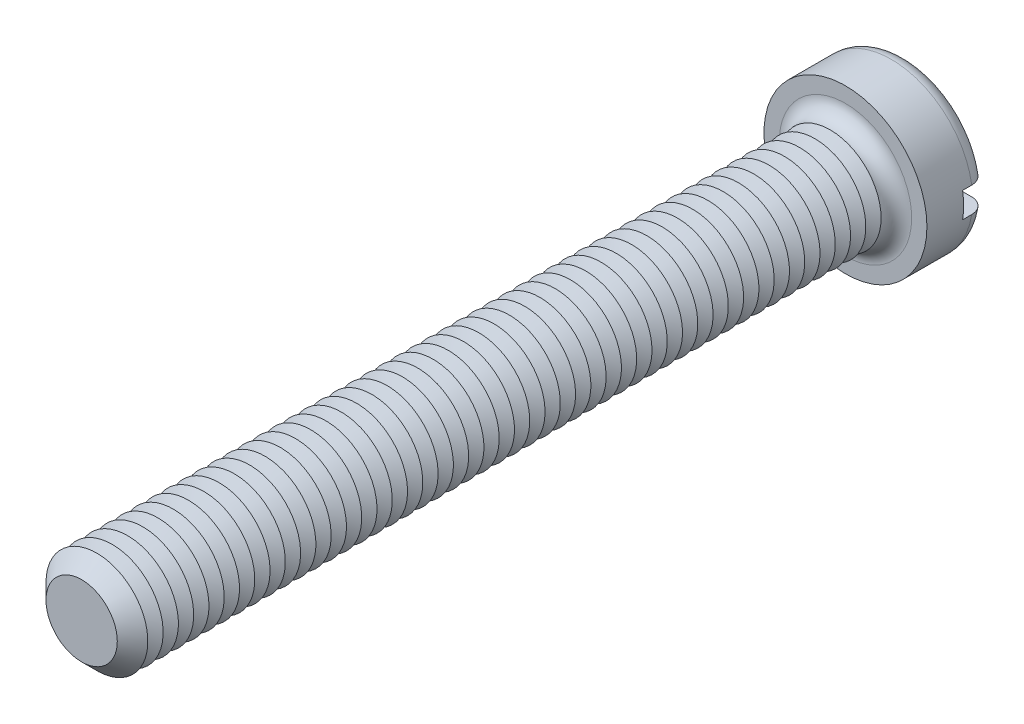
from build123d import *

# Parameters (mm, degrees)
SKETCH3_R           = 8
BOSS_EXTRUDE2_DEPTH = 6
SKETCH4_R           = 5
BOSS_EXTRUDE3_DEPTH = 75
FILLET1_R           = 1.5
CHAMFER1_SIZE       = 1.5
LPATTERN1_COUNT     = 48
LPATTERN1_PITCH     = 1.5
SKETCH8_W           = 16
SKETCH8_H           = 2.5
CUT_EXTRUDE1_DEPTH  = 2.4


with BuildPart() as part:
    # Sketch3 → Boss-Extrude2 (new body)
    with BuildSketch(Plane.XY):
        Circle(SKETCH3_R)
    extrude(amount=-BOSS_EXTRUDE2_DEPTH)

    # Sketch4 → Boss-Extrude3 (add)
    with BuildSketch(Plane.XY):
        Circle(SKETCH4_R)
    extrude(amount=BOSS_EXTRUDE3_DEPTH)

    # Fillet1
    fillet1_edges = [part.edges().sort_by_distance(p)[0] for p in [
        (-8, 0, -6),
        (-5, 0, 0),
    ]]
    fillet(fillet1_edges, radius=FILLET1_R)

    # Chamfer1
    chamfer1_edges = [part.edges().sort_by_distance(p)[0] for p in [
        (-5, 0, 75),
    ]]
    chamfer(chamfer1_edges, length=CHAMFER1_SIZE)

    # Sketch6 → Cut-Revolve1 (revolve, cut)
    with BuildSketch(Plane(origin=(0, 0, 0), x_dir=(0, 0, -1), z_dir=(1, 0, 0)), mode=Mode.PRIVATE) as cut_revolve1_sk:
        Polygon((-1.5, 5), (-2.25, 3.700961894), (-3, 5), align=None)
    cut_revolve1 = revolve(cut_revolve1_sk.sketch.rotate(Axis((0, 0, -1.694361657), (0, 0, 1)), 90), axis=Axis((0, 0, -1.694361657), (0, 0, 1)), mode=Mode.SUBTRACT)

    # LPattern1: Cut-Revolve1 ×48
    with Locations(*[(0, 0, i * LPATTERN1_PITCH) for i in range(1, LPATTERN1_COUNT)]):
        add(cut_revolve1, mode=Mode.SUBTRACT)

    # Sketch8 → Cut-Extrude1 (cut)
    with BuildSketch(Plane(origin=(0, 0, -6), x_dir=(-1, 0, 0), z_dir=(0, 0, -1))):
        Rectangle(SKETCH8_W, SKETCH8_H)
    extrude(amount=-CUT_EXTRUDE1_DEPTH, mode=Mode.SUBTRACT)


solid = part.part
